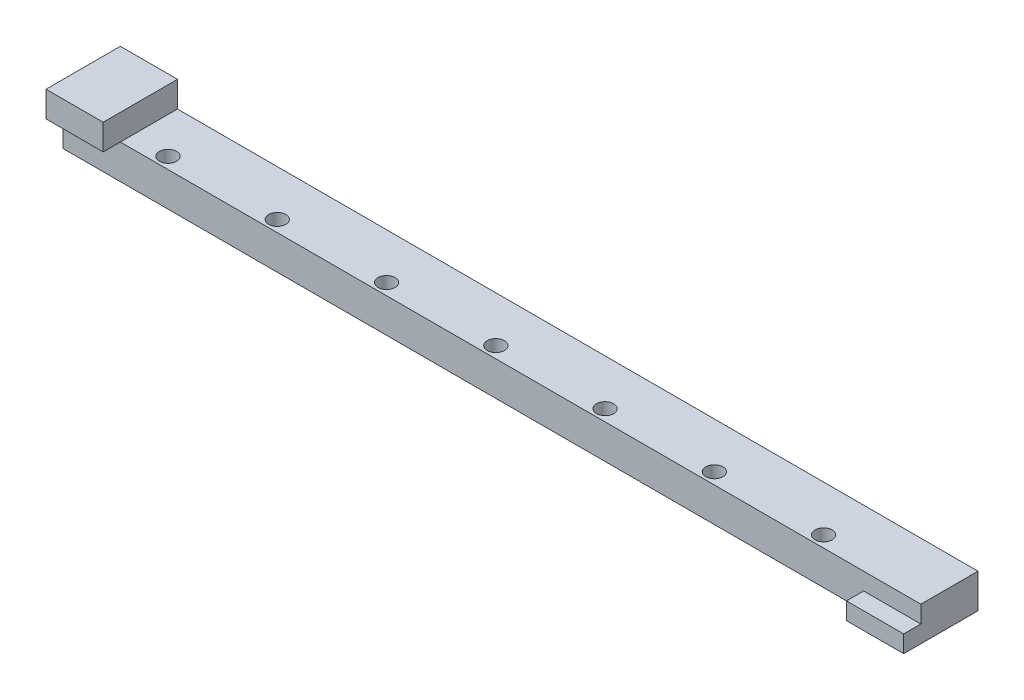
ISO-10303-21;
HEADER;
FILE_DESCRIPTION(('STEP AP214'),'2;1');
FILE_NAME('part.step','',(''),(''),'','','');
FILE_SCHEMA(('AUTOMOTIVE_DESIGN { 1 0 10303 214 1 1 1 1 }'));
ENDSEC;
DATA;
#1=APPLICATION_CONTEXT('core data for automotive mechanical design processes');
#2=APPLICATION_PROTOCOL_DEFINITION('international standard','automotive_design',2000,#1);
#3=PRODUCT_CONTEXT('',#1,'mechanical');
#4=PRODUCT('Part','Part','',(#3));
#5=PRODUCT_RELATED_PRODUCT_CATEGORY('part','',(#4));
#6=PRODUCT_DEFINITION_FORMATION('','',#4);
#7=PRODUCT_DEFINITION_CONTEXT('part definition',#1,'design');
#8=PRODUCT_DEFINITION('design','',#6,#7);
#9=PRODUCT_DEFINITION_SHAPE('','',#8);
#10=(LENGTH_UNIT() NAMED_UNIT(*) SI_UNIT(.MILLI.,.METRE.));
#11=(NAMED_UNIT(*) PLANE_ANGLE_UNIT() SI_UNIT($,.RADIAN.));
#12=(NAMED_UNIT(*) SI_UNIT($,.STERADIAN.) SOLID_ANGLE_UNIT());
#13=UNCERTAINTY_MEASURE_WITH_UNIT(LENGTH_MEASURE(1.E-05),#10,'distance_accuracy_value','');
#14=(GEOMETRIC_REPRESENTATION_CONTEXT(3) GLOBAL_UNCERTAINTY_ASSIGNED_CONTEXT((#13)) GLOBAL_UNIT_ASSIGNED_CONTEXT((#10,
#11,#12)) REPRESENTATION_CONTEXT('',''));
#15=CARTESIAN_POINT('',(0.,0.,0.));
#16=DIRECTION('',(0.,0.,1.));
#17=DIRECTION('',(1.,0.,0.));
#18=AXIS2_PLACEMENT_3D('',#15,#16,#17);
#19=CARTESIAN_POINT('',(0.,6.,0.));
#20=DIRECTION('',(0.,0.,-1.));
#21=DIRECTION('',(-1.,0.,0.));
#22=AXIS2_PLACEMENT_3D('',#19,#20,#21);
#23=PLANE('',#22);
#24=DIRECTION('',(1.,0.,0.));
#25=VECTOR('',#24,1.);
#26=CARTESIAN_POINT('',(10.,6.,0.));
#27=LINE('',#26,#25);
#28=CARTESIAN_POINT('',(0.,6.,0.));
#29=VERTEX_POINT('',#28);
#30=CARTESIAN_POINT('',(10.,6.,0.));
#31=VERTEX_POINT('',#30);
#32=EDGE_CURVE('E147',#29,#31,#27,.T.);
#33=ORIENTED_EDGE('',*,*,#32,.F.);
#34=DIRECTION('',(0.,-1.,0.));
#35=VECTOR('',#34,1.);
#36=CARTESIAN_POINT('',(0.,6.,0.));
#37=LINE('',#36,#35);
#38=CARTESIAN_POINT('',(0.,0.,0.));
#39=VERTEX_POINT('',#38);
#40=EDGE_CURVE('E11',#29,#39,#37,.T.);
#41=ORIENTED_EDGE('',*,*,#40,.T.);
#42=DIRECTION('',(1.,0.,0.));
#43=VECTOR('',#42,1.);
#44=CARTESIAN_POINT('',(0.,0.,0.));
#45=LINE('',#44,#43);
#46=CARTESIAN_POINT('',(140.,0.,0.));
#47=VERTEX_POINT('',#46);
#48=EDGE_CURVE('E60',#39,#47,#45,.T.);
#49=ORIENTED_EDGE('',*,*,#48,.T.);
#50=DIRECTION('',(0.,-1.,0.));
#51=VECTOR('',#50,1.);
#52=CARTESIAN_POINT('',(140.,3.,0.));
#53=LINE('',#52,#51);
#54=CARTESIAN_POINT('',(140.,3.,0.));
#55=VERTEX_POINT('',#54);
#56=EDGE_CURVE('E235',#55,#47,#53,.T.);
#57=ORIENTED_EDGE('',*,*,#56,.F.);
#58=DIRECTION('',(-1.,0.,0.));
#59=VECTOR('',#58,1.);
#60=CARTESIAN_POINT('',(150.,3.,0.));
#61=LINE('',#60,#59);
#62=CARTESIAN_POINT('',(150.,3.,0.));
#63=VERTEX_POINT('',#62);
#64=EDGE_CURVE('E55',#63,#55,#61,.T.);
#65=ORIENTED_EDGE('',*,*,#64,.F.);
#66=DIRECTION('',(0.,-1.,0.));
#67=VECTOR('',#66,1.);
#68=CARTESIAN_POINT('',(150.,6.,0.));
#69=LINE('',#68,#67);
#70=CARTESIAN_POINT('',(150.,6.,0.));
#71=VERTEX_POINT('',#70);
#72=EDGE_CURVE('E48',#71,#63,#69,.T.);
#73=ORIENTED_EDGE('',*,*,#72,.F.);
#74=DIRECTION('',(1.,0.,0.));
#75=VECTOR('',#74,1.);
#76=CARTESIAN_POINT('',(0.,6.,0.));
#77=LINE('',#76,#75);
#78=EDGE_CURVE('E262',#31,#71,#77,.T.);
#79=ORIENTED_EDGE('',*,*,#78,.F.);
#80=EDGE_LOOP('',(#33,#41,#49,#57,#65,#73,#79));
#81=FACE_BOUND('',#80,.T.);
#82=ADVANCED_FACE('F39',(#81),#23,.F.);
#83=CARTESIAN_POINT('',(0.,6.,-10.));
#84=DIRECTION('',(1.,0.,0.));
#85=DIRECTION('',(0.,0.,-1.));
#86=AXIS2_PLACEMENT_3D('',#83,#84,#85);
#87=PLANE('',#86);
#88=DIRECTION('',(0.,0.,1.));
#89=VECTOR('',#88,1.);
#90=CARTESIAN_POINT('',(0.,0.,-10.));
#91=LINE('',#90,#89);
#92=CARTESIAN_POINT('',(0.,0.,-10.));
#93=VERTEX_POINT('',#92);
#94=EDGE_CURVE('E261',#93,#39,#91,.T.);
#95=ORIENTED_EDGE('',*,*,#94,.T.);
#96=ORIENTED_EDGE('',*,*,#40,.F.);
#97=DIRECTION('',(0.,0.,-1.));
#98=VECTOR('',#97,1.);
#99=CARTESIAN_POINT('',(0.,6.,3.));
#100=LINE('',#99,#98);
#101=CARTESIAN_POINT('',(0.,6.,3.));
#102=VERTEX_POINT('',#101);
#103=EDGE_CURVE('E136',#102,#29,#100,.T.);
#104=ORIENTED_EDGE('',*,*,#103,.F.);
#105=DIRECTION('',(0.,-1.,0.));
#106=VECTOR('',#105,1.);
#107=CARTESIAN_POINT('',(0.,6.,3.));
#108=LINE('',#107,#106);
#109=CARTESIAN_POINT('',(0.,10.5,3.));
#110=VERTEX_POINT('',#109);
#111=EDGE_CURVE('E133',#110,#102,#108,.T.);
#112=ORIENTED_EDGE('',*,*,#111,.F.);
#113=DIRECTION('',(0.,0.,1.));
#114=VECTOR('',#113,1.);
#115=CARTESIAN_POINT('',(0.,10.5,-10.));
#116=LINE('',#115,#114);
#117=CARTESIAN_POINT('',(0.,10.5,-10.));
#118=VERTEX_POINT('',#117);
#119=EDGE_CURVE('E120',#118,#110,#116,.T.);
#120=ORIENTED_EDGE('',*,*,#119,.F.);
#121=DIRECTION('',(0.,-1.,0.));
#122=VECTOR('',#121,1.);
#123=CARTESIAN_POINT('',(0.,6.,-10.));
#124=LINE('',#123,#122);
#125=EDGE_CURVE('E272',#118,#93,#124,.T.);
#126=ORIENTED_EDGE('',*,*,#125,.T.);
#127=EDGE_LOOP('',(#95,#96,#104,#112,#120,#126));
#128=FACE_BOUND('',#127,.T.);
#129=ADVANCED_FACE('F41',(#128),#87,.F.);
#130=CARTESIAN_POINT('',(150.,6.,0.));
#131=DIRECTION('',(-1.,0.,0.));
#132=DIRECTION('',(0.,0.,1.));
#133=AXIS2_PLACEMENT_3D('',#130,#131,#132);
#134=PLANE('',#133);
#135=DIRECTION('',(0.,0.,-1.));
#136=VECTOR('',#135,1.);
#137=CARTESIAN_POINT('',(150.,0.,0.));
#138=LINE('',#137,#136);
#139=CARTESIAN_POINT('',(150.,0.,3.));
#140=VERTEX_POINT('',#139);
#141=CARTESIAN_POINT('',(150.,0.,-10.));
#142=VERTEX_POINT('',#141);
#143=EDGE_CURVE('E277',#140,#142,#138,.T.);
#144=ORIENTED_EDGE('',*,*,#143,.T.);
#145=DIRECTION('',(0.,-1.,0.));
#146=VECTOR('',#145,1.);
#147=CARTESIAN_POINT('',(150.,6.,-10.));
#148=LINE('',#147,#146);
#149=CARTESIAN_POINT('',(150.,6.,-10.));
#150=VERTEX_POINT('',#149);
#151=EDGE_CURVE('E284',#150,#142,#148,.T.);
#152=ORIENTED_EDGE('',*,*,#151,.F.);
#153=DIRECTION('',(0.,0.,-1.));
#154=VECTOR('',#153,1.);
#155=CARTESIAN_POINT('',(150.,6.,0.));
#156=LINE('',#155,#154);
#157=EDGE_CURVE('E265',#71,#150,#156,.T.);
#158=ORIENTED_EDGE('',*,*,#157,.F.);
#159=ORIENTED_EDGE('',*,*,#72,.T.);
#160=DIRECTION('',(0.,0.,-1.));
#161=VECTOR('',#160,1.);
#162=CARTESIAN_POINT('',(150.,3.,3.));
#163=LINE('',#162,#161);
#164=CARTESIAN_POINT('',(150.,3.,3.));
#165=VERTEX_POINT('',#164);
#166=EDGE_CURVE('E257',#165,#63,#163,.T.);
#167=ORIENTED_EDGE('',*,*,#166,.F.);
#168=DIRECTION('',(0.,1.,0.));
#169=VECTOR('',#168,1.);
#170=CARTESIAN_POINT('',(150.,0.,3.));
#171=LINE('',#170,#169);
#172=EDGE_CURVE('E230',#140,#165,#171,.T.);
#173=ORIENTED_EDGE('',*,*,#172,.F.);
#174=EDGE_LOOP('',(#144,#152,#158,#159,#167,#173));
#175=FACE_BOUND('',#174,.T.);
#176=ADVANCED_FACE('F291',(#175),#134,.F.);
#177=CARTESIAN_POINT('',(150.,6.,-10.));
#178=DIRECTION('',(0.,0.,1.));
#179=DIRECTION('',(1.,0.,0.));
#180=AXIS2_PLACEMENT_3D('',#177,#178,#179);
#181=PLANE('',#180);
#182=DIRECTION('',(-1.,0.,0.));
#183=VECTOR('',#182,1.);
#184=CARTESIAN_POINT('',(150.,0.,-10.));
#185=LINE('',#184,#183);
#186=EDGE_CURVE('E266',#142,#93,#185,.T.);
#187=ORIENTED_EDGE('',*,*,#186,.T.);
#188=ORIENTED_EDGE('',*,*,#125,.F.);
#189=DIRECTION('',(-1.,0.,0.));
#190=VECTOR('',#189,1.);
#191=CARTESIAN_POINT('',(10.,10.5,-10.));
#192=LINE('',#191,#190);
#193=CARTESIAN_POINT('',(10.,10.5,-10.));
#194=VERTEX_POINT('',#193);
#195=EDGE_CURVE('E126',#194,#118,#192,.T.);
#196=ORIENTED_EDGE('',*,*,#195,.F.);
#197=DIRECTION('',(0.,-1.,0.));
#198=VECTOR('',#197,1.);
#199=CARTESIAN_POINT('',(10.,10.5,-10.));
#200=LINE('',#199,#198);
#201=CARTESIAN_POINT('',(10.,6.,-10.));
#202=VERTEX_POINT('',#201);
#203=EDGE_CURVE('E167',#194,#202,#200,.T.);
#204=ORIENTED_EDGE('',*,*,#203,.T.);
#205=DIRECTION('',(-1.,0.,0.));
#206=VECTOR('',#205,1.);
#207=CARTESIAN_POINT('',(150.,6.,-10.));
#208=LINE('',#207,#206);
#209=EDGE_CURVE('E269',#150,#202,#208,.T.);
#210=ORIENTED_EDGE('',*,*,#209,.F.);
#211=ORIENTED_EDGE('',*,*,#151,.T.);
#212=EDGE_LOOP('',(#187,#188,#196,#204,#210,#211));
#213=FACE_BOUND('',#212,.T.);
#214=ADVANCED_FACE('F306',(#213),#181,.F.);
#215=CARTESIAN_POINT('',(0.,6.,0.));
#216=DIRECTION('',(0.,1.,0.));
#217=DIRECTION('',(0.,0.,1.));
#218=AXIS2_PLACEMENT_3D('',#215,#216,#217);
#219=PLANE('',#218);
#220=DIRECTION('',(0.,0.,-1.));
#221=VECTOR('',#220,1.);
#222=CARTESIAN_POINT('',(10.,6.,0.));
#223=LINE('',#222,#221);
#224=EDGE_CURVE('E162',#31,#202,#223,.T.);
#225=ORIENTED_EDGE('',*,*,#224,.F.);
#226=ORIENTED_EDGE('',*,*,#78,.T.);
#227=ORIENTED_EDGE('',*,*,#157,.T.);
#228=ORIENTED_EDGE('',*,*,#209,.T.);
#229=EDGE_LOOP('',(#225,#226,#227,#228));
#230=FACE_BOUND('',#229,.T.);
#231=CARTESIAN_POINT('',(131.,6.,-2.));
#232=DIRECTION('',(0.,1.,0.));
#233=DIRECTION('',(0.,0.,1.));
#234=AXIS2_PLACEMENT_3D('',#231,#232,#233);
#235=CIRCLE('',#234,1.5);
#236=CARTESIAN_POINT('',(131.,6.,-0.500000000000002));
#237=VERTEX_POINT('',#236);
#238=EDGE_CURVE('E179',#237,#237,#235,.T.);
#239=ORIENTED_EDGE('',*,*,#238,.F.);
#240=EDGE_LOOP('',(#239));
#241=FACE_BOUND('',#240,.T.);
#242=CARTESIAN_POINT('',(54.56,6.,-1.99999999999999));
#243=DIRECTION('',(0.,1.,0.));
#244=DIRECTION('',(0.,0.,1.));
#245=AXIS2_PLACEMENT_3D('',#242,#243,#244);
#246=CIRCLE('',#245,1.5);
#247=CARTESIAN_POINT('',(54.56,6.,-0.499999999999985));
#248=VERTEX_POINT('',#247);
#249=EDGE_CURVE('E174',#248,#248,#246,.T.);
#250=ORIENTED_EDGE('',*,*,#249,.F.);
#251=EDGE_LOOP('',(#250));
#252=FACE_BOUND('',#251,.T.);
#253=CARTESIAN_POINT('',(35.45,6.,-1.99999999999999));
#254=DIRECTION('',(0.,1.,0.));
#255=DIRECTION('',(0.,0.,1.));
#256=AXIS2_PLACEMENT_3D('',#253,#254,#255);
#257=CIRCLE('',#256,1.5);
#258=CARTESIAN_POINT('',(35.45,6.,-0.499999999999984));
#259=VERTEX_POINT('',#258);
#260=EDGE_CURVE('E189',#259,#259,#257,.T.);
#261=ORIENTED_EDGE('',*,*,#260,.F.);
#262=EDGE_LOOP('',(#261));
#263=FACE_BOUND('',#262,.T.);
#264=CARTESIAN_POINT('',(16.34,6.,-1.99999999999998));
#265=DIRECTION('',(0.,1.,0.));
#266=DIRECTION('',(0.,0.,1.));
#267=AXIS2_PLACEMENT_3D('',#264,#265,#266);
#268=CIRCLE('',#267,1.5);
#269=CARTESIAN_POINT('',(16.34,6.,-0.499999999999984));
#270=VERTEX_POINT('',#269);
#271=EDGE_CURVE('E188',#270,#270,#268,.T.);
#272=ORIENTED_EDGE('',*,*,#271,.F.);
#273=EDGE_LOOP('',(#272));
#274=FACE_BOUND('',#273,.T.);
#275=CARTESIAN_POINT('',(73.67,6.,-1.99999999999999));
#276=DIRECTION('',(0.,1.,0.));
#277=DIRECTION('',(0.,0.,1.));
#278=AXIS2_PLACEMENT_3D('',#275,#276,#277);
#279=CIRCLE('',#278,1.5);
#280=CARTESIAN_POINT('',(73.67,6.,-0.499999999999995));
#281=VERTEX_POINT('',#280);
#282=EDGE_CURVE('E219',#281,#281,#279,.T.);
#283=ORIENTED_EDGE('',*,*,#282,.F.);
#284=EDGE_LOOP('',(#283));
#285=FACE_BOUND('',#284,.T.);
#286=CARTESIAN_POINT('',(92.78,6.,-1.99999999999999));
#287=DIRECTION('',(0.,1.,0.));
#288=DIRECTION('',(0.,0.,1.));
#289=AXIS2_PLACEMENT_3D('',#286,#287,#288);
#290=CIRCLE('',#289,1.5);
#291=CARTESIAN_POINT('',(92.78,6.,-0.499999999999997));
#292=VERTEX_POINT('',#291);
#293=EDGE_CURVE('E211',#292,#292,#290,.T.);
#294=ORIENTED_EDGE('',*,*,#293,.F.);
#295=EDGE_LOOP('',(#294));
#296=FACE_BOUND('',#295,.T.);
#297=CARTESIAN_POINT('',(111.89,6.,-2.));
#298=DIRECTION('',(0.,1.,0.));
#299=DIRECTION('',(0.,0.,1.));
#300=AXIS2_PLACEMENT_3D('',#297,#298,#299);
#301=CIRCLE('',#300,1.5);
#302=CARTESIAN_POINT('',(111.89,6.,-0.499999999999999));
#303=VERTEX_POINT('',#302);
#304=EDGE_CURVE('E203',#303,#303,#301,.T.);
#305=ORIENTED_EDGE('',*,*,#304,.F.);
#306=EDGE_LOOP('',(#305));
#307=FACE_BOUND('',#306,.T.);
#308=ADVANCED_FACE('F315',(#230,#241,#252,#263,#274,#285,#296,#307),#219,.T.);
#309=CARTESIAN_POINT('',(0.,0.,0.));
#310=DIRECTION('',(0.,1.,0.));
#311=DIRECTION('',(0.,0.,1.));
#312=AXIS2_PLACEMENT_3D('',#309,#310,#311);
#313=PLANE('',#312);
#314=CARTESIAN_POINT('',(131.,0.,-2.));
#315=DIRECTION('',(0.,1.,0.));
#316=DIRECTION('',(0.,0.,1.));
#317=AXIS2_PLACEMENT_3D('',#314,#315,#316);
#318=CIRCLE('',#317,1.5);
#319=CARTESIAN_POINT('',(131.,0.,-0.500000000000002));
#320=VERTEX_POINT('',#319);
#321=EDGE_CURVE('E175',#320,#320,#318,.T.);
#322=ORIENTED_EDGE('',*,*,#321,.T.);
#323=EDGE_LOOP('',(#322));
#324=FACE_BOUND('',#323,.T.);
#325=CARTESIAN_POINT('',(54.56,0.,-1.99999999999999));
#326=DIRECTION('',(0.,1.,0.));
#327=DIRECTION('',(0.,0.,1.));
#328=AXIS2_PLACEMENT_3D('',#325,#326,#327);
#329=CIRCLE('',#328,1.5);
#330=CARTESIAN_POINT('',(54.56,0.,-0.499999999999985));
#331=VERTEX_POINT('',#330);
#332=EDGE_CURVE('E193',#331,#331,#329,.T.);
#333=ORIENTED_EDGE('',*,*,#332,.T.);
#334=EDGE_LOOP('',(#333));
#335=FACE_BOUND('',#334,.T.);
#336=CARTESIAN_POINT('',(35.45,0.,-1.99999999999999));
#337=DIRECTION('',(0.,1.,0.));
#338=DIRECTION('',(0.,0.,1.));
#339=AXIS2_PLACEMENT_3D('',#336,#337,#338);
#340=CIRCLE('',#339,1.5);
#341=CARTESIAN_POINT('',(35.45,0.,-0.499999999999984));
#342=VERTEX_POINT('',#341);
#343=EDGE_CURVE('E184',#342,#342,#340,.T.);
#344=ORIENTED_EDGE('',*,*,#343,.T.);
#345=EDGE_LOOP('',(#344));
#346=FACE_BOUND('',#345,.T.);
#347=CARTESIAN_POINT('',(16.34,0.,-1.99999999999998));
#348=DIRECTION('',(0.,1.,0.));
#349=DIRECTION('',(0.,0.,1.));
#350=AXIS2_PLACEMENT_3D('',#347,#348,#349);
#351=CIRCLE('',#350,1.5);
#352=CARTESIAN_POINT('',(16.34,0.,-0.499999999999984));
#353=VERTEX_POINT('',#352);
#354=EDGE_CURVE('E223',#353,#353,#351,.T.);
#355=ORIENTED_EDGE('',*,*,#354,.T.);
#356=EDGE_LOOP('',(#355));
#357=FACE_BOUND('',#356,.T.);
#358=CARTESIAN_POINT('',(73.67,0.,-1.99999999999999));
#359=DIRECTION('',(0.,1.,0.));
#360=DIRECTION('',(0.,0.,1.));
#361=AXIS2_PLACEMENT_3D('',#358,#359,#360);
#362=CIRCLE('',#361,1.5);
#363=CARTESIAN_POINT('',(73.67,0.,-0.499999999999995));
#364=VERTEX_POINT('',#363);
#365=EDGE_CURVE('E215',#364,#364,#362,.T.);
#366=ORIENTED_EDGE('',*,*,#365,.T.);
#367=EDGE_LOOP('',(#366));
#368=FACE_BOUND('',#367,.T.);
#369=CARTESIAN_POINT('',(92.78,0.,-1.99999999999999));
#370=DIRECTION('',(0.,1.,0.));
#371=DIRECTION('',(0.,0.,1.));
#372=AXIS2_PLACEMENT_3D('',#369,#370,#371);
#373=CIRCLE('',#372,1.5);
#374=CARTESIAN_POINT('',(92.78,0.,-0.499999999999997));
#375=VERTEX_POINT('',#374);
#376=EDGE_CURVE('E207',#375,#375,#373,.T.);
#377=ORIENTED_EDGE('',*,*,#376,.T.);
#378=EDGE_LOOP('',(#377));
#379=FACE_BOUND('',#378,.T.);
#380=CARTESIAN_POINT('',(111.89,0.,-2.));
#381=DIRECTION('',(0.,1.,0.));
#382=DIRECTION('',(0.,0.,1.));
#383=AXIS2_PLACEMENT_3D('',#380,#381,#382);
#384=CIRCLE('',#383,1.5);
#385=CARTESIAN_POINT('',(111.89,0.,-0.499999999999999));
#386=VERTEX_POINT('',#385);
#387=EDGE_CURVE('E183',#386,#386,#384,.T.);
#388=ORIENTED_EDGE('',*,*,#387,.T.);
#389=EDGE_LOOP('',(#388));
#390=FACE_BOUND('',#389,.T.);
#391=ORIENTED_EDGE('',*,*,#94,.F.);
#392=ORIENTED_EDGE('',*,*,#186,.F.);
#393=ORIENTED_EDGE('',*,*,#143,.F.);
#394=DIRECTION('',(1.,0.,0.));
#395=VECTOR('',#394,1.);
#396=CARTESIAN_POINT('',(150.,0.,3.));
#397=LINE('',#396,#395);
#398=CARTESIAN_POINT('',(140.,0.,3.));
#399=VERTEX_POINT('',#398);
#400=EDGE_CURVE('E241',#399,#140,#397,.T.);
#401=ORIENTED_EDGE('',*,*,#400,.F.);
#402=DIRECTION('',(0.,0.,-1.));
#403=VECTOR('',#402,1.);
#404=CARTESIAN_POINT('',(140.,0.,3.));
#405=LINE('',#404,#403);
#406=EDGE_CURVE('E245',#399,#47,#405,.T.);
#407=ORIENTED_EDGE('',*,*,#406,.T.);
#408=ORIENTED_EDGE('',*,*,#48,.F.);
#409=EDGE_LOOP('',(#391,#392,#393,#401,#407,#408));
#410=FACE_BOUND('',#409,.T.);
#411=ADVANCED_FACE('F308',(#324,#335,#346,#357,#368,#379,#390,#410),#313,.F.);
#412=CARTESIAN_POINT('',(150.,3.,3.));
#413=DIRECTION('',(0.,-1.,0.));
#414=DIRECTION('',(1.,0.,0.));
#415=AXIS2_PLACEMENT_3D('',#412,#413,#414);
#416=PLANE('',#415);
#417=ORIENTED_EDGE('',*,*,#64,.T.);
#418=DIRECTION('',(0.,0.,-1.));
#419=VECTOR('',#418,1.);
#420=CARTESIAN_POINT('',(140.,3.,3.));
#421=LINE('',#420,#419);
#422=CARTESIAN_POINT('',(140.,3.,3.));
#423=VERTEX_POINT('',#422);
#424=EDGE_CURVE('E253',#423,#55,#421,.T.);
#425=ORIENTED_EDGE('',*,*,#424,.F.);
#426=DIRECTION('',(-1.,0.,0.));
#427=VECTOR('',#426,1.);
#428=CARTESIAN_POINT('',(150.,3.,3.));
#429=LINE('',#428,#427);
#430=EDGE_CURVE('E234',#165,#423,#429,.T.);
#431=ORIENTED_EDGE('',*,*,#430,.F.);
#432=ORIENTED_EDGE('',*,*,#166,.T.);
#433=EDGE_LOOP('',(#417,#425,#431,#432));
#434=FACE_BOUND('',#433,.T.);
#435=ADVANCED_FACE('F296',(#434),#416,.F.);
#436=CARTESIAN_POINT('',(140.,3.,3.));
#437=DIRECTION('',(1.,0.,0.));
#438=DIRECTION('',(0.,0.,-1.));
#439=AXIS2_PLACEMENT_3D('',#436,#437,#438);
#440=PLANE('',#439);
#441=ORIENTED_EDGE('',*,*,#56,.T.);
#442=ORIENTED_EDGE('',*,*,#406,.F.);
#443=DIRECTION('',(0.,-1.,0.));
#444=VECTOR('',#443,1.);
#445=CARTESIAN_POINT('',(140.,3.,3.));
#446=LINE('',#445,#444);
#447=EDGE_CURVE('E238',#423,#399,#446,.T.);
#448=ORIENTED_EDGE('',*,*,#447,.F.);
#449=ORIENTED_EDGE('',*,*,#424,.T.);
#450=EDGE_LOOP('',(#441,#442,#448,#449));
#451=FACE_BOUND('',#450,.T.);
#452=ADVANCED_FACE('F344',(#451),#440,.F.);
#453=CARTESIAN_POINT('',(0.,0.,3.));
#454=DIRECTION('',(0.,0.,1.));
#455=DIRECTION('',(1.,0.,0.));
#456=AXIS2_PLACEMENT_3D('',#453,#454,#455);
#457=PLANE('',#456);
#458=ORIENTED_EDGE('',*,*,#172,.T.);
#459=ORIENTED_EDGE('',*,*,#430,.T.);
#460=ORIENTED_EDGE('',*,*,#447,.T.);
#461=ORIENTED_EDGE('',*,*,#400,.T.);
#462=EDGE_LOOP('',(#458,#459,#460,#461));
#463=FACE_BOUND('',#462,.T.);
#464=ADVANCED_FACE('F300',(#463),#457,.T.);
#465=CARTESIAN_POINT('',(111.89,0.,-2.));
#466=DIRECTION('',(0.,1.,0.));
#467=DIRECTION('',(0.,0.,1.));
#468=AXIS2_PLACEMENT_3D('',#465,#466,#467);
#469=CYLINDRICAL_SURFACE('',#468,1.5);
#470=CARTESIAN_POINT('',(111.89,0.,-0.499999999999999));
#471=CARTESIAN_POINT('',(111.89,0.0624999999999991,-0.499999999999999));
#472=CARTESIAN_POINT('',(111.89,0.124999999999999,-0.499999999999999));
#473=CARTESIAN_POINT('',(111.89,0.249999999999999,-0.499999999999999));
#474=CARTESIAN_POINT('',(111.89,0.312499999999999,-0.499999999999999));
#475=CARTESIAN_POINT('',(111.89,0.437499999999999,-0.499999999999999));
#476=CARTESIAN_POINT('',(111.89,0.499999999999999,-0.499999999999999));
#477=CARTESIAN_POINT('',(111.89,0.624999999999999,-0.499999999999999));
#478=CARTESIAN_POINT('',(111.89,0.687499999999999,-0.499999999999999));
#479=CARTESIAN_POINT('',(111.89,0.812499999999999,-0.499999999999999));
#480=CARTESIAN_POINT('',(111.89,0.874999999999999,-0.499999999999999));
#481=CARTESIAN_POINT('',(111.89,0.999999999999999,-0.499999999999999));
#482=CARTESIAN_POINT('',(111.89,1.0625,-0.499999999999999));
#483=CARTESIAN_POINT('',(111.89,1.1875,-0.499999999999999));
#484=CARTESIAN_POINT('',(111.89,1.25,-0.499999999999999));
#485=CARTESIAN_POINT('',(111.89,1.375,-0.499999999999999));
#486=CARTESIAN_POINT('',(111.89,1.4375,-0.499999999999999));
#487=CARTESIAN_POINT('',(111.89,1.5625,-0.499999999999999));
#488=CARTESIAN_POINT('',(111.89,1.625,-0.499999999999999));
#489=CARTESIAN_POINT('',(111.89,1.75,-0.499999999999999));
#490=CARTESIAN_POINT('',(111.89,1.8125,-0.499999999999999));
#491=CARTESIAN_POINT('',(111.89,1.9375,-0.499999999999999));
#492=CARTESIAN_POINT('',(111.89,2.,-0.499999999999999));
#493=CARTESIAN_POINT('',(111.89,2.125,-0.499999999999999));
#494=CARTESIAN_POINT('',(111.89,2.1875,-0.499999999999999));
#495=CARTESIAN_POINT('',(111.89,2.3125,-0.499999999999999));
#496=CARTESIAN_POINT('',(111.89,2.375,-0.499999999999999));
#497=CARTESIAN_POINT('',(111.89,2.5,-0.499999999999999));
#498=CARTESIAN_POINT('',(111.89,2.5625,-0.499999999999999));
#499=CARTESIAN_POINT('',(111.89,2.6875,-0.499999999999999));
#500=CARTESIAN_POINT('',(111.89,2.75,-0.499999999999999));
#501=CARTESIAN_POINT('',(111.89,2.875,-0.499999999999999));
#502=CARTESIAN_POINT('',(111.89,2.9375,-0.499999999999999));
#503=CARTESIAN_POINT('',(111.89,3.0625,-0.499999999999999));
#504=CARTESIAN_POINT('',(111.89,3.125,-0.499999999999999));
#505=CARTESIAN_POINT('',(111.89,3.25,-0.499999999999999));
#506=CARTESIAN_POINT('',(111.89,3.3125,-0.499999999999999));
#507=CARTESIAN_POINT('',(111.89,3.4375,-0.499999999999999));
#508=CARTESIAN_POINT('',(111.89,3.5,-0.499999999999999));
#509=CARTESIAN_POINT('',(111.89,3.625,-0.499999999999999));
#510=CARTESIAN_POINT('',(111.89,3.6875,-0.499999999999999));
#511=CARTESIAN_POINT('',(111.89,3.8125,-0.499999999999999));
#512=CARTESIAN_POINT('',(111.89,3.875,-0.499999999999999));
#513=CARTESIAN_POINT('',(111.89,4.,-0.499999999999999));
#514=CARTESIAN_POINT('',(111.89,4.0625,-0.499999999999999));
#515=CARTESIAN_POINT('',(111.89,4.1875,-0.499999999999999));
#516=CARTESIAN_POINT('',(111.89,4.25,-0.499999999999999));
#517=CARTESIAN_POINT('',(111.89,4.375,-0.499999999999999));
#518=CARTESIAN_POINT('',(111.89,4.4375,-0.499999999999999));
#519=CARTESIAN_POINT('',(111.89,4.5625,-0.499999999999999));
#520=CARTESIAN_POINT('',(111.89,4.625,-0.499999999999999));
#521=CARTESIAN_POINT('',(111.89,4.75,-0.499999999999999));
#522=CARTESIAN_POINT('',(111.89,4.8125,-0.499999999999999));
#523=CARTESIAN_POINT('',(111.89,4.9375,-0.499999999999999));
#524=CARTESIAN_POINT('',(111.89,5.,-0.499999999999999));
#525=CARTESIAN_POINT('',(111.89,5.125,-0.499999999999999));
#526=CARTESIAN_POINT('',(111.89,5.1875,-0.499999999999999));
#527=CARTESIAN_POINT('',(111.89,5.3125,-0.499999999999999));
#528=CARTESIAN_POINT('',(111.89,5.375,-0.499999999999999));
#529=CARTESIAN_POINT('',(111.89,5.5,-0.499999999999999));
#530=CARTESIAN_POINT('',(111.89,5.5625,-0.499999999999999));
#531=CARTESIAN_POINT('',(111.89,5.6875,-0.499999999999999));
#532=CARTESIAN_POINT('',(111.89,5.75,-0.499999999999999));
#533=CARTESIAN_POINT('',(111.89,5.875,-0.499999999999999));
#534=CARTESIAN_POINT('',(111.89,5.9375,-0.499999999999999));
#535=CARTESIAN_POINT('',(111.89,6.,-0.499999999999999));
#536=B_SPLINE_CURVE_WITH_KNOTS('',3,(#470,#471,#472,#473,#474,#475,#476,#477,#478,#479,#480,
#481,#482,#483,#484,#485,#486,#487,#488,#489,#490,#491,#492,#493,#494,#495,#496,#497,#498,#499,
#500,#501,#502,#503,#504,#505,#506,#507,#508,#509,#510,#511,#512,#513,#514,#515,#516,#517,#518,
#519,#520,#521,#522,#523,#524,#525,#526,#527,#528,#529,#530,#531,#532,#533,#534,#535),
.UNSPECIFIED.,.F.,.F.,(4,2,2,2,2,2,2,2,2,2,2,2,2,2,2,2,2,2,2,2,2,2,2,2,2,2,2,2,2,2,2,2,4),(0.,
0.1875,0.375,0.5625,0.75,0.9375,1.125,1.3125,1.5,1.6875,1.875,2.0625,2.25,2.4375,2.625,2.8125,
3.,3.1875,3.375,3.5625,3.75,3.9375,4.125,4.3125,4.5,4.6875,4.875,5.0625,5.25,5.4375,5.625,
5.8125,6.),.UNSPECIFIED.);
#537=EDGE_CURVE('BSEAM350',#386,#303,#536,.T.);
#538=ORIENTED_EDGE('',*,*,#387,.F.);
#539=ORIENTED_EDGE('',*,*,#304,.T.);
#540=ORIENTED_EDGE('',*,*,#537,.T.);
#541=ORIENTED_EDGE('',*,*,#537,.F.);
#542=EDGE_LOOP('',(#538,#540,#539,#541));
#543=FACE_BOUND('',#542,.T.);
#544=ADVANCED_FACE('F350',(#543),#469,.F.);
#545=CARTESIAN_POINT('',(92.78,0.,-1.99999999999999));
#546=DIRECTION('',(0.,1.,0.));
#547=DIRECTION('',(0.,0.,1.));
#548=AXIS2_PLACEMENT_3D('',#545,#546,#547);
#549=CYLINDRICAL_SURFACE('',#548,1.5);
#550=CARTESIAN_POINT('',(92.78,0.,-0.499999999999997));
#551=CARTESIAN_POINT('',(92.78,0.0624999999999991,-0.499999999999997));
#552=CARTESIAN_POINT('',(92.78,0.124999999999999,-0.499999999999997));
#553=CARTESIAN_POINT('',(92.78,0.249999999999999,-0.499999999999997));
#554=CARTESIAN_POINT('',(92.78,0.312499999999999,-0.499999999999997));
#555=CARTESIAN_POINT('',(92.78,0.437499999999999,-0.499999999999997));
#556=CARTESIAN_POINT('',(92.78,0.499999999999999,-0.499999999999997));
#557=CARTESIAN_POINT('',(92.78,0.624999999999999,-0.499999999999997));
#558=CARTESIAN_POINT('',(92.78,0.687499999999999,-0.499999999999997));
#559=CARTESIAN_POINT('',(92.78,0.812499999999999,-0.499999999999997));
#560=CARTESIAN_POINT('',(92.78,0.874999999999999,-0.499999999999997));
#561=CARTESIAN_POINT('',(92.78,0.999999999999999,-0.499999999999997));
#562=CARTESIAN_POINT('',(92.78,1.0625,-0.499999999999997));
#563=CARTESIAN_POINT('',(92.78,1.1875,-0.499999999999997));
#564=CARTESIAN_POINT('',(92.78,1.25,-0.499999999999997));
#565=CARTESIAN_POINT('',(92.78,1.375,-0.499999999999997));
#566=CARTESIAN_POINT('',(92.78,1.4375,-0.499999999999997));
#567=CARTESIAN_POINT('',(92.78,1.5625,-0.499999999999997));
#568=CARTESIAN_POINT('',(92.78,1.625,-0.499999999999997));
#569=CARTESIAN_POINT('',(92.78,1.75,-0.499999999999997));
#570=CARTESIAN_POINT('',(92.78,1.8125,-0.499999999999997));
#571=CARTESIAN_POINT('',(92.78,1.9375,-0.499999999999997));
#572=CARTESIAN_POINT('',(92.78,2.,-0.499999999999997));
#573=CARTESIAN_POINT('',(92.78,2.125,-0.499999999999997));
#574=CARTESIAN_POINT('',(92.78,2.1875,-0.499999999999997));
#575=CARTESIAN_POINT('',(92.78,2.3125,-0.499999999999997));
#576=CARTESIAN_POINT('',(92.78,2.375,-0.499999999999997));
#577=CARTESIAN_POINT('',(92.78,2.5,-0.499999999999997));
#578=CARTESIAN_POINT('',(92.78,2.5625,-0.499999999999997));
#579=CARTESIAN_POINT('',(92.78,2.6875,-0.499999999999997));
#580=CARTESIAN_POINT('',(92.78,2.75,-0.499999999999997));
#581=CARTESIAN_POINT('',(92.78,2.875,-0.499999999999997));
#582=CARTESIAN_POINT('',(92.78,2.9375,-0.499999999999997));
#583=CARTESIAN_POINT('',(92.78,3.0625,-0.499999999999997));
#584=CARTESIAN_POINT('',(92.78,3.125,-0.499999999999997));
#585=CARTESIAN_POINT('',(92.78,3.25,-0.499999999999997));
#586=CARTESIAN_POINT('',(92.78,3.3125,-0.499999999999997));
#587=CARTESIAN_POINT('',(92.78,3.4375,-0.499999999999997));
#588=CARTESIAN_POINT('',(92.78,3.5,-0.499999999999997));
#589=CARTESIAN_POINT('',(92.78,3.625,-0.499999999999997));
#590=CARTESIAN_POINT('',(92.78,3.6875,-0.499999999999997));
#591=CARTESIAN_POINT('',(92.78,3.8125,-0.499999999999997));
#592=CARTESIAN_POINT('',(92.78,3.875,-0.499999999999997));
#593=CARTESIAN_POINT('',(92.78,4.,-0.499999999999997));
#594=CARTESIAN_POINT('',(92.78,4.0625,-0.499999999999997));
#595=CARTESIAN_POINT('',(92.78,4.1875,-0.499999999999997));
#596=CARTESIAN_POINT('',(92.78,4.25,-0.499999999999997));
#597=CARTESIAN_POINT('',(92.78,4.375,-0.499999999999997));
#598=CARTESIAN_POINT('',(92.78,4.4375,-0.499999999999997));
#599=CARTESIAN_POINT('',(92.78,4.5625,-0.499999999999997));
#600=CARTESIAN_POINT('',(92.78,4.625,-0.499999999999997));
#601=CARTESIAN_POINT('',(92.78,4.75,-0.499999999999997));
#602=CARTESIAN_POINT('',(92.78,4.8125,-0.499999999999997));
#603=CARTESIAN_POINT('',(92.78,4.9375,-0.499999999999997));
#604=CARTESIAN_POINT('',(92.78,5.,-0.499999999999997));
#605=CARTESIAN_POINT('',(92.78,5.125,-0.499999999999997));
#606=CARTESIAN_POINT('',(92.78,5.1875,-0.499999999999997));
#607=CARTESIAN_POINT('',(92.78,5.3125,-0.499999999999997));
#608=CARTESIAN_POINT('',(92.78,5.375,-0.499999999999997));
#609=CARTESIAN_POINT('',(92.78,5.5,-0.499999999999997));
#610=CARTESIAN_POINT('',(92.78,5.5625,-0.499999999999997));
#611=CARTESIAN_POINT('',(92.78,5.6875,-0.499999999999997));
#612=CARTESIAN_POINT('',(92.78,5.75,-0.499999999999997));
#613=CARTESIAN_POINT('',(92.78,5.875,-0.499999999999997));
#614=CARTESIAN_POINT('',(92.78,5.9375,-0.499999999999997));
#615=CARTESIAN_POINT('',(92.78,6.,-0.499999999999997));
#616=B_SPLINE_CURVE_WITH_KNOTS('',3,(#550,#551,#552,#553,#554,#555,#556,#557,#558,#559,#560,
#561,#562,#563,#564,#565,#566,#567,#568,#569,#570,#571,#572,#573,#574,#575,#576,#577,#578,#579,
#580,#581,#582,#583,#584,#585,#586,#587,#588,#589,#590,#591,#592,#593,#594,#595,#596,#597,#598,
#599,#600,#601,#602,#603,#604,#605,#606,#607,#608,#609,#610,#611,#612,#613,#614,#615),
.UNSPECIFIED.,.F.,.F.,(4,2,2,2,2,2,2,2,2,2,2,2,2,2,2,2,2,2,2,2,2,2,2,2,2,2,2,2,2,2,2,2,4),(0.,
0.1875,0.375,0.5625,0.75,0.9375,1.125,1.3125,1.5,1.6875,1.875,2.0625,2.25,2.4375,2.625,2.8125,
3.,3.1875,3.375,3.5625,3.75,3.9375,4.125,4.3125,4.5,4.6875,4.875,5.0625,5.25,5.4375,5.625,
5.8125,6.),.UNSPECIFIED.);
#617=EDGE_CURVE('BSEAM359',#375,#292,#616,.T.);
#618=ORIENTED_EDGE('',*,*,#376,.F.);
#619=ORIENTED_EDGE('',*,*,#293,.T.);
#620=ORIENTED_EDGE('',*,*,#617,.T.);
#621=ORIENTED_EDGE('',*,*,#617,.F.);
#622=EDGE_LOOP('',(#618,#620,#619,#621));
#623=FACE_BOUND('',#622,.T.);
#624=ADVANCED_FACE('F359',(#623),#549,.F.);
#625=CARTESIAN_POINT('',(73.67,0.,-1.99999999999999));
#626=DIRECTION('',(0.,1.,0.));
#627=DIRECTION('',(0.,0.,1.));
#628=AXIS2_PLACEMENT_3D('',#625,#626,#627);
#629=CYLINDRICAL_SURFACE('',#628,1.5);
#630=CARTESIAN_POINT('',(73.67,0.,-0.499999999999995));
#631=CARTESIAN_POINT('',(73.67,0.0624999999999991,-0.499999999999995));
#632=CARTESIAN_POINT('',(73.67,0.124999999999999,-0.499999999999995));
#633=CARTESIAN_POINT('',(73.67,0.249999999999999,-0.499999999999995));
#634=CARTESIAN_POINT('',(73.67,0.312499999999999,-0.499999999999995));
#635=CARTESIAN_POINT('',(73.67,0.437499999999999,-0.499999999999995));
#636=CARTESIAN_POINT('',(73.67,0.499999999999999,-0.499999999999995));
#637=CARTESIAN_POINT('',(73.67,0.624999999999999,-0.499999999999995));
#638=CARTESIAN_POINT('',(73.67,0.687499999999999,-0.499999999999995));
#639=CARTESIAN_POINT('',(73.67,0.812499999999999,-0.499999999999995));
#640=CARTESIAN_POINT('',(73.67,0.874999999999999,-0.499999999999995));
#641=CARTESIAN_POINT('',(73.67,0.999999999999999,-0.499999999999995));
#642=CARTESIAN_POINT('',(73.67,1.0625,-0.499999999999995));
#643=CARTESIAN_POINT('',(73.67,1.1875,-0.499999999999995));
#644=CARTESIAN_POINT('',(73.67,1.25,-0.499999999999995));
#645=CARTESIAN_POINT('',(73.67,1.375,-0.499999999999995));
#646=CARTESIAN_POINT('',(73.67,1.4375,-0.499999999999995));
#647=CARTESIAN_POINT('',(73.67,1.5625,-0.499999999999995));
#648=CARTESIAN_POINT('',(73.67,1.625,-0.499999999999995));
#649=CARTESIAN_POINT('',(73.67,1.75,-0.499999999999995));
#650=CARTESIAN_POINT('',(73.67,1.8125,-0.499999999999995));
#651=CARTESIAN_POINT('',(73.67,1.9375,-0.499999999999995));
#652=CARTESIAN_POINT('',(73.67,2.,-0.499999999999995));
#653=CARTESIAN_POINT('',(73.67,2.125,-0.499999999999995));
#654=CARTESIAN_POINT('',(73.67,2.1875,-0.499999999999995));
#655=CARTESIAN_POINT('',(73.67,2.3125,-0.499999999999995));
#656=CARTESIAN_POINT('',(73.67,2.375,-0.499999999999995));
#657=CARTESIAN_POINT('',(73.67,2.5,-0.499999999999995));
#658=CARTESIAN_POINT('',(73.67,2.5625,-0.499999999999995));
#659=CARTESIAN_POINT('',(73.67,2.6875,-0.499999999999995));
#660=CARTESIAN_POINT('',(73.67,2.75,-0.499999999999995));
#661=CARTESIAN_POINT('',(73.67,2.875,-0.499999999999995));
#662=CARTESIAN_POINT('',(73.67,2.9375,-0.499999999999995));
#663=CARTESIAN_POINT('',(73.67,3.0625,-0.499999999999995));
#664=CARTESIAN_POINT('',(73.67,3.125,-0.499999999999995));
#665=CARTESIAN_POINT('',(73.67,3.25,-0.499999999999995));
#666=CARTESIAN_POINT('',(73.67,3.3125,-0.499999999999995));
#667=CARTESIAN_POINT('',(73.67,3.4375,-0.499999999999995));
#668=CARTESIAN_POINT('',(73.67,3.5,-0.499999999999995));
#669=CARTESIAN_POINT('',(73.67,3.625,-0.499999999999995));
#670=CARTESIAN_POINT('',(73.67,3.6875,-0.499999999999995));
#671=CARTESIAN_POINT('',(73.67,3.8125,-0.499999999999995));
#672=CARTESIAN_POINT('',(73.67,3.875,-0.499999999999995));
#673=CARTESIAN_POINT('',(73.67,4.,-0.499999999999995));
#674=CARTESIAN_POINT('',(73.67,4.0625,-0.499999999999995));
#675=CARTESIAN_POINT('',(73.67,4.1875,-0.499999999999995));
#676=CARTESIAN_POINT('',(73.67,4.25,-0.499999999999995));
#677=CARTESIAN_POINT('',(73.67,4.375,-0.499999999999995));
#678=CARTESIAN_POINT('',(73.67,4.4375,-0.499999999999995));
#679=CARTESIAN_POINT('',(73.67,4.5625,-0.499999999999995));
#680=CARTESIAN_POINT('',(73.67,4.625,-0.499999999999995));
#681=CARTESIAN_POINT('',(73.67,4.75,-0.499999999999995));
#682=CARTESIAN_POINT('',(73.67,4.8125,-0.499999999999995));
#683=CARTESIAN_POINT('',(73.67,4.9375,-0.499999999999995));
#684=CARTESIAN_POINT('',(73.67,5.,-0.499999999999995));
#685=CARTESIAN_POINT('',(73.67,5.125,-0.499999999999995));
#686=CARTESIAN_POINT('',(73.67,5.1875,-0.499999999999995));
#687=CARTESIAN_POINT('',(73.67,5.3125,-0.499999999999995));
#688=CARTESIAN_POINT('',(73.67,5.375,-0.499999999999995));
#689=CARTESIAN_POINT('',(73.67,5.5,-0.499999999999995));
#690=CARTESIAN_POINT('',(73.67,5.5625,-0.499999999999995));
#691=CARTESIAN_POINT('',(73.67,5.6875,-0.499999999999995));
#692=CARTESIAN_POINT('',(73.67,5.75,-0.499999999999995));
#693=CARTESIAN_POINT('',(73.67,5.875,-0.499999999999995));
#694=CARTESIAN_POINT('',(73.67,5.9375,-0.499999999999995));
#695=CARTESIAN_POINT('',(73.67,6.,-0.499999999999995));
#696=B_SPLINE_CURVE_WITH_KNOTS('',3,(#630,#631,#632,#633,#634,#635,#636,#637,#638,#639,#640,
#641,#642,#643,#644,#645,#646,#647,#648,#649,#650,#651,#652,#653,#654,#655,#656,#657,#658,#659,
#660,#661,#662,#663,#664,#665,#666,#667,#668,#669,#670,#671,#672,#673,#674,#675,#676,#677,#678,
#679,#680,#681,#682,#683,#684,#685,#686,#687,#688,#689,#690,#691,#692,#693,#694,#695),
.UNSPECIFIED.,.F.,.F.,(4,2,2,2,2,2,2,2,2,2,2,2,2,2,2,2,2,2,2,2,2,2,2,2,2,2,2,2,2,2,2,2,4),(0.,
0.1875,0.375,0.5625,0.75,0.9375,1.125,1.3125,1.5,1.6875,1.875,2.0625,2.25,2.4375,2.625,2.8125,
3.,3.1875,3.375,3.5625,3.75,3.9375,4.125,4.3125,4.5,4.6875,4.875,5.0625,5.25,5.4375,5.625,
5.8125,6.),.UNSPECIFIED.);
#697=EDGE_CURVE('BSEAM355',#364,#281,#696,.T.);
#698=ORIENTED_EDGE('',*,*,#365,.F.);
#699=ORIENTED_EDGE('',*,*,#282,.T.);
#700=ORIENTED_EDGE('',*,*,#697,.T.);
#701=ORIENTED_EDGE('',*,*,#697,.F.);
#702=EDGE_LOOP('',(#698,#700,#699,#701));
#703=FACE_BOUND('',#702,.T.);
#704=ADVANCED_FACE('F355',(#703),#629,.F.);
#705=CARTESIAN_POINT('',(16.34,0.,-1.99999999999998));
#706=DIRECTION('',(0.,1.,0.));
#707=DIRECTION('',(0.,0.,1.));
#708=AXIS2_PLACEMENT_3D('',#705,#706,#707);
#709=CYLINDRICAL_SURFACE('',#708,1.5);
#710=CARTESIAN_POINT('',(16.34,0.,-0.499999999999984));
#711=CARTESIAN_POINT('',(16.34,0.0624999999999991,-0.499999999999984));
#712=CARTESIAN_POINT('',(16.34,0.124999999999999,-0.499999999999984));
#713=CARTESIAN_POINT('',(16.34,0.249999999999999,-0.499999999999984));
#714=CARTESIAN_POINT('',(16.34,0.312499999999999,-0.499999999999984));
#715=CARTESIAN_POINT('',(16.34,0.437499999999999,-0.499999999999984));
#716=CARTESIAN_POINT('',(16.34,0.499999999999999,-0.499999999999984));
#717=CARTESIAN_POINT('',(16.34,0.624999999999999,-0.499999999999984));
#718=CARTESIAN_POINT('',(16.34,0.687499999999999,-0.499999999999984));
#719=CARTESIAN_POINT('',(16.34,0.812499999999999,-0.499999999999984));
#720=CARTESIAN_POINT('',(16.34,0.874999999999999,-0.499999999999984));
#721=CARTESIAN_POINT('',(16.34,0.999999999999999,-0.499999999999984));
#722=CARTESIAN_POINT('',(16.34,1.0625,-0.499999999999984));
#723=CARTESIAN_POINT('',(16.34,1.1875,-0.499999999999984));
#724=CARTESIAN_POINT('',(16.34,1.25,-0.499999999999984));
#725=CARTESIAN_POINT('',(16.34,1.375,-0.499999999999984));
#726=CARTESIAN_POINT('',(16.34,1.4375,-0.499999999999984));
#727=CARTESIAN_POINT('',(16.34,1.5625,-0.499999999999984));
#728=CARTESIAN_POINT('',(16.34,1.625,-0.499999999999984));
#729=CARTESIAN_POINT('',(16.34,1.75,-0.499999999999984));
#730=CARTESIAN_POINT('',(16.34,1.8125,-0.499999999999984));
#731=CARTESIAN_POINT('',(16.34,1.9375,-0.499999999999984));
#732=CARTESIAN_POINT('',(16.34,2.,-0.499999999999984));
#733=CARTESIAN_POINT('',(16.34,2.125,-0.499999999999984));
#734=CARTESIAN_POINT('',(16.34,2.1875,-0.499999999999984));
#735=CARTESIAN_POINT('',(16.34,2.3125,-0.499999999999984));
#736=CARTESIAN_POINT('',(16.34,2.375,-0.499999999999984));
#737=CARTESIAN_POINT('',(16.34,2.5,-0.499999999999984));
#738=CARTESIAN_POINT('',(16.34,2.5625,-0.499999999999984));
#739=CARTESIAN_POINT('',(16.34,2.6875,-0.499999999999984));
#740=CARTESIAN_POINT('',(16.34,2.75,-0.499999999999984));
#741=CARTESIAN_POINT('',(16.34,2.875,-0.499999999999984));
#742=CARTESIAN_POINT('',(16.34,2.9375,-0.499999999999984));
#743=CARTESIAN_POINT('',(16.34,3.0625,-0.499999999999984));
#744=CARTESIAN_POINT('',(16.34,3.125,-0.499999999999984));
#745=CARTESIAN_POINT('',(16.34,3.25,-0.499999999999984));
#746=CARTESIAN_POINT('',(16.34,3.3125,-0.499999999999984));
#747=CARTESIAN_POINT('',(16.34,3.4375,-0.499999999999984));
#748=CARTESIAN_POINT('',(16.34,3.5,-0.499999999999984));
#749=CARTESIAN_POINT('',(16.34,3.625,-0.499999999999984));
#750=CARTESIAN_POINT('',(16.34,3.6875,-0.499999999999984));
#751=CARTESIAN_POINT('',(16.34,3.8125,-0.499999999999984));
#752=CARTESIAN_POINT('',(16.34,3.875,-0.499999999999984));
#753=CARTESIAN_POINT('',(16.34,4.,-0.499999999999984));
#754=CARTESIAN_POINT('',(16.34,4.0625,-0.499999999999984));
#755=CARTESIAN_POINT('',(16.34,4.1875,-0.499999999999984));
#756=CARTESIAN_POINT('',(16.34,4.25,-0.499999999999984));
#757=CARTESIAN_POINT('',(16.34,4.375,-0.499999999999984));
#758=CARTESIAN_POINT('',(16.34,4.4375,-0.499999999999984));
#759=CARTESIAN_POINT('',(16.34,4.5625,-0.499999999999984));
#760=CARTESIAN_POINT('',(16.34,4.625,-0.499999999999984));
#761=CARTESIAN_POINT('',(16.34,4.75,-0.499999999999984));
#762=CARTESIAN_POINT('',(16.34,4.8125,-0.499999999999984));
#763=CARTESIAN_POINT('',(16.34,4.9375,-0.499999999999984));
#764=CARTESIAN_POINT('',(16.34,5.,-0.499999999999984));
#765=CARTESIAN_POINT('',(16.34,5.125,-0.499999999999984));
#766=CARTESIAN_POINT('',(16.34,5.1875,-0.499999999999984));
#767=CARTESIAN_POINT('',(16.34,5.3125,-0.499999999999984));
#768=CARTESIAN_POINT('',(16.34,5.375,-0.499999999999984));
#769=CARTESIAN_POINT('',(16.34,5.5,-0.499999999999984));
#770=CARTESIAN_POINT('',(16.34,5.5625,-0.499999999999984));
#771=CARTESIAN_POINT('',(16.34,5.6875,-0.499999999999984));
#772=CARTESIAN_POINT('',(16.34,5.75,-0.499999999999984));
#773=CARTESIAN_POINT('',(16.34,5.875,-0.499999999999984));
#774=CARTESIAN_POINT('',(16.34,5.9375,-0.499999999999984));
#775=CARTESIAN_POINT('',(16.34,6.,-0.499999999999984));
#776=B_SPLINE_CURVE_WITH_KNOTS('',3,(#710,#711,#712,#713,#714,#715,#716,#717,#718,#719,#720,
#721,#722,#723,#724,#725,#726,#727,#728,#729,#730,#731,#732,#733,#734,#735,#736,#737,#738,#739,
#740,#741,#742,#743,#744,#745,#746,#747,#748,#749,#750,#751,#752,#753,#754,#755,#756,#757,#758,
#759,#760,#761,#762,#763,#764,#765,#766,#767,#768,#769,#770,#771,#772,#773,#774,#775),
.UNSPECIFIED.,.F.,.F.,(4,2,2,2,2,2,2,2,2,2,2,2,2,2,2,2,2,2,2,2,2,2,2,2,2,2,2,2,2,2,2,2,4),(0.,
0.1875,0.375,0.5625,0.75,0.9375,1.125,1.3125,1.5,1.6875,1.875,2.0625,2.25,2.4375,2.625,2.8125,
3.,3.1875,3.375,3.5625,3.75,3.9375,4.125,4.3125,4.5,4.6875,4.875,5.0625,5.25,5.4375,5.625,
5.8125,6.),.UNSPECIFIED.);
#777=EDGE_CURVE('BSEAM351',#353,#270,#776,.T.);
#778=ORIENTED_EDGE('',*,*,#354,.F.);
#779=ORIENTED_EDGE('',*,*,#271,.T.);
#780=ORIENTED_EDGE('',*,*,#777,.T.);
#781=ORIENTED_EDGE('',*,*,#777,.F.);
#782=EDGE_LOOP('',(#778,#780,#779,#781));
#783=FACE_BOUND('',#782,.T.);
#784=ADVANCED_FACE('F351',(#783),#709,.F.);
#785=CARTESIAN_POINT('',(35.45,0.,-1.99999999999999));
#786=DIRECTION('',(0.,1.,0.));
#787=DIRECTION('',(0.,0.,1.));
#788=AXIS2_PLACEMENT_3D('',#785,#786,#787);
#789=CYLINDRICAL_SURFACE('',#788,1.5);
#790=CARTESIAN_POINT('',(35.45,0.,-0.499999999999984));
#791=CARTESIAN_POINT('',(35.45,0.0624999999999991,-0.499999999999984));
#792=CARTESIAN_POINT('',(35.45,0.124999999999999,-0.499999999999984));
#793=CARTESIAN_POINT('',(35.45,0.249999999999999,-0.499999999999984));
#794=CARTESIAN_POINT('',(35.45,0.312499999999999,-0.499999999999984));
#795=CARTESIAN_POINT('',(35.45,0.437499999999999,-0.499999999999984));
#796=CARTESIAN_POINT('',(35.45,0.499999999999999,-0.499999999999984));
#797=CARTESIAN_POINT('',(35.45,0.624999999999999,-0.499999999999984));
#798=CARTESIAN_POINT('',(35.45,0.687499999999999,-0.499999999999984));
#799=CARTESIAN_POINT('',(35.45,0.812499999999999,-0.499999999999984));
#800=CARTESIAN_POINT('',(35.45,0.874999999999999,-0.499999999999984));
#801=CARTESIAN_POINT('',(35.45,0.999999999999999,-0.499999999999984));
#802=CARTESIAN_POINT('',(35.45,1.0625,-0.499999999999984));
#803=CARTESIAN_POINT('',(35.45,1.1875,-0.499999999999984));
#804=CARTESIAN_POINT('',(35.45,1.25,-0.499999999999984));
#805=CARTESIAN_POINT('',(35.45,1.375,-0.499999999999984));
#806=CARTESIAN_POINT('',(35.45,1.4375,-0.499999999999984));
#807=CARTESIAN_POINT('',(35.45,1.5625,-0.499999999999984));
#808=CARTESIAN_POINT('',(35.45,1.625,-0.499999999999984));
#809=CARTESIAN_POINT('',(35.45,1.75,-0.499999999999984));
#810=CARTESIAN_POINT('',(35.45,1.8125,-0.499999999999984));
#811=CARTESIAN_POINT('',(35.45,1.9375,-0.499999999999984));
#812=CARTESIAN_POINT('',(35.45,2.,-0.499999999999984));
#813=CARTESIAN_POINT('',(35.45,2.125,-0.499999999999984));
#814=CARTESIAN_POINT('',(35.45,2.1875,-0.499999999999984));
#815=CARTESIAN_POINT('',(35.45,2.3125,-0.499999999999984));
#816=CARTESIAN_POINT('',(35.45,2.375,-0.499999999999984));
#817=CARTESIAN_POINT('',(35.45,2.5,-0.499999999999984));
#818=CARTESIAN_POINT('',(35.45,2.5625,-0.499999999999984));
#819=CARTESIAN_POINT('',(35.45,2.6875,-0.499999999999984));
#820=CARTESIAN_POINT('',(35.45,2.75,-0.499999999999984));
#821=CARTESIAN_POINT('',(35.45,2.875,-0.499999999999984));
#822=CARTESIAN_POINT('',(35.45,2.9375,-0.499999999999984));
#823=CARTESIAN_POINT('',(35.45,3.0625,-0.499999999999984));
#824=CARTESIAN_POINT('',(35.45,3.125,-0.499999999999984));
#825=CARTESIAN_POINT('',(35.45,3.25,-0.499999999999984));
#826=CARTESIAN_POINT('',(35.45,3.3125,-0.499999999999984));
#827=CARTESIAN_POINT('',(35.45,3.4375,-0.499999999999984));
#828=CARTESIAN_POINT('',(35.45,3.5,-0.499999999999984));
#829=CARTESIAN_POINT('',(35.45,3.625,-0.499999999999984));
#830=CARTESIAN_POINT('',(35.45,3.6875,-0.499999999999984));
#831=CARTESIAN_POINT('',(35.45,3.8125,-0.499999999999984));
#832=CARTESIAN_POINT('',(35.45,3.875,-0.499999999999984));
#833=CARTESIAN_POINT('',(35.45,4.,-0.499999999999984));
#834=CARTESIAN_POINT('',(35.45,4.0625,-0.499999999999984));
#835=CARTESIAN_POINT('',(35.45,4.1875,-0.499999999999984));
#836=CARTESIAN_POINT('',(35.45,4.25,-0.499999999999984));
#837=CARTESIAN_POINT('',(35.45,4.375,-0.499999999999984));
#838=CARTESIAN_POINT('',(35.45,4.4375,-0.499999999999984));
#839=CARTESIAN_POINT('',(35.45,4.5625,-0.499999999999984));
#840=CARTESIAN_POINT('',(35.45,4.625,-0.499999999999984));
#841=CARTESIAN_POINT('',(35.45,4.75,-0.499999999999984));
#842=CARTESIAN_POINT('',(35.45,4.8125,-0.499999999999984));
#843=CARTESIAN_POINT('',(35.45,4.9375,-0.499999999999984));
#844=CARTESIAN_POINT('',(35.45,5.,-0.499999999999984));
#845=CARTESIAN_POINT('',(35.45,5.125,-0.499999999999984));
#846=CARTESIAN_POINT('',(35.45,5.1875,-0.499999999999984));
#847=CARTESIAN_POINT('',(35.45,5.3125,-0.499999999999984));
#848=CARTESIAN_POINT('',(35.45,5.375,-0.499999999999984));
#849=CARTESIAN_POINT('',(35.45,5.5,-0.499999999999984));
#850=CARTESIAN_POINT('',(35.45,5.5625,-0.499999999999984));
#851=CARTESIAN_POINT('',(35.45,5.6875,-0.499999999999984));
#852=CARTESIAN_POINT('',(35.45,5.75,-0.499999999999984));
#853=CARTESIAN_POINT('',(35.45,5.875,-0.499999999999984));
#854=CARTESIAN_POINT('',(35.45,5.9375,-0.499999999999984));
#855=CARTESIAN_POINT('',(35.45,6.,-0.499999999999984));
#856=B_SPLINE_CURVE_WITH_KNOTS('',3,(#790,#791,#792,#793,#794,#795,#796,#797,#798,#799,#800,
#801,#802,#803,#804,#805,#806,#807,#808,#809,#810,#811,#812,#813,#814,#815,#816,#817,#818,#819,
#820,#821,#822,#823,#824,#825,#826,#827,#828,#829,#830,#831,#832,#833,#834,#835,#836,#837,#838,
#839,#840,#841,#842,#843,#844,#845,#846,#847,#848,#849,#850,#851,#852,#853,#854,#855),
.UNSPECIFIED.,.F.,.F.,(4,2,2,2,2,2,2,2,2,2,2,2,2,2,2,2,2,2,2,2,2,2,2,2,2,2,2,2,2,2,2,2,4),(0.,
0.1875,0.375,0.5625,0.75,0.9375,1.125,1.3125,1.5,1.6875,1.875,2.0625,2.25,2.4375,2.625,2.8125,
3.,3.1875,3.375,3.5625,3.75,3.9375,4.125,4.3125,4.5,4.6875,4.875,5.0625,5.25,5.4375,5.625,
5.8125,6.),.UNSPECIFIED.);
#857=EDGE_CURVE('BSEAM354',#342,#259,#856,.T.);
#858=ORIENTED_EDGE('',*,*,#343,.F.);
#859=ORIENTED_EDGE('',*,*,#260,.T.);
#860=ORIENTED_EDGE('',*,*,#857,.T.);
#861=ORIENTED_EDGE('',*,*,#857,.F.);
#862=EDGE_LOOP('',(#858,#860,#859,#861));
#863=FACE_BOUND('',#862,.T.);
#864=ADVANCED_FACE('F354',(#863),#789,.F.);
#865=CARTESIAN_POINT('',(54.56,0.,-1.99999999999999));
#866=DIRECTION('',(0.,1.,0.));
#867=DIRECTION('',(0.,0.,1.));
#868=AXIS2_PLACEMENT_3D('',#865,#866,#867);
#869=CYLINDRICAL_SURFACE('',#868,1.5);
#870=CARTESIAN_POINT('',(54.56,0.,-0.499999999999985));
#871=CARTESIAN_POINT('',(54.56,0.0624999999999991,-0.499999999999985));
#872=CARTESIAN_POINT('',(54.56,0.124999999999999,-0.499999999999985));
#873=CARTESIAN_POINT('',(54.56,0.249999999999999,-0.499999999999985));
#874=CARTESIAN_POINT('',(54.56,0.312499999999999,-0.499999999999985));
#875=CARTESIAN_POINT('',(54.56,0.437499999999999,-0.499999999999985));
#876=CARTESIAN_POINT('',(54.56,0.499999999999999,-0.499999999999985));
#877=CARTESIAN_POINT('',(54.56,0.624999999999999,-0.499999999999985));
#878=CARTESIAN_POINT('',(54.56,0.687499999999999,-0.499999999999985));
#879=CARTESIAN_POINT('',(54.56,0.812499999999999,-0.499999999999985));
#880=CARTESIAN_POINT('',(54.56,0.874999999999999,-0.499999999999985));
#881=CARTESIAN_POINT('',(54.56,0.999999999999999,-0.499999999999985));
#882=CARTESIAN_POINT('',(54.56,1.0625,-0.499999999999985));
#883=CARTESIAN_POINT('',(54.56,1.1875,-0.499999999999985));
#884=CARTESIAN_POINT('',(54.56,1.25,-0.499999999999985));
#885=CARTESIAN_POINT('',(54.56,1.375,-0.499999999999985));
#886=CARTESIAN_POINT('',(54.56,1.4375,-0.499999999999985));
#887=CARTESIAN_POINT('',(54.56,1.5625,-0.499999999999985));
#888=CARTESIAN_POINT('',(54.56,1.625,-0.499999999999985));
#889=CARTESIAN_POINT('',(54.56,1.75,-0.499999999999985));
#890=CARTESIAN_POINT('',(54.56,1.8125,-0.499999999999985));
#891=CARTESIAN_POINT('',(54.56,1.9375,-0.499999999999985));
#892=CARTESIAN_POINT('',(54.56,2.,-0.499999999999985));
#893=CARTESIAN_POINT('',(54.56,2.125,-0.499999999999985));
#894=CARTESIAN_POINT('',(54.56,2.1875,-0.499999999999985));
#895=CARTESIAN_POINT('',(54.56,2.3125,-0.499999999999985));
#896=CARTESIAN_POINT('',(54.56,2.375,-0.499999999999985));
#897=CARTESIAN_POINT('',(54.56,2.5,-0.499999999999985));
#898=CARTESIAN_POINT('',(54.56,2.5625,-0.499999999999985));
#899=CARTESIAN_POINT('',(54.56,2.6875,-0.499999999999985));
#900=CARTESIAN_POINT('',(54.56,2.75,-0.499999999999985));
#901=CARTESIAN_POINT('',(54.56,2.875,-0.499999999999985));
#902=CARTESIAN_POINT('',(54.56,2.9375,-0.499999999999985));
#903=CARTESIAN_POINT('',(54.56,3.0625,-0.499999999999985));
#904=CARTESIAN_POINT('',(54.56,3.125,-0.499999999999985));
#905=CARTESIAN_POINT('',(54.56,3.25,-0.499999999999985));
#906=CARTESIAN_POINT('',(54.56,3.3125,-0.499999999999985));
#907=CARTESIAN_POINT('',(54.56,3.4375,-0.499999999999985));
#908=CARTESIAN_POINT('',(54.56,3.5,-0.499999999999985));
#909=CARTESIAN_POINT('',(54.56,3.625,-0.499999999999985));
#910=CARTESIAN_POINT('',(54.56,3.6875,-0.499999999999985));
#911=CARTESIAN_POINT('',(54.56,3.8125,-0.499999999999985));
#912=CARTESIAN_POINT('',(54.56,3.875,-0.499999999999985));
#913=CARTESIAN_POINT('',(54.56,4.,-0.499999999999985));
#914=CARTESIAN_POINT('',(54.56,4.0625,-0.499999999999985));
#915=CARTESIAN_POINT('',(54.56,4.1875,-0.499999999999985));
#916=CARTESIAN_POINT('',(54.56,4.25,-0.499999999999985));
#917=CARTESIAN_POINT('',(54.56,4.375,-0.499999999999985));
#918=CARTESIAN_POINT('',(54.56,4.4375,-0.499999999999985));
#919=CARTESIAN_POINT('',(54.56,4.5625,-0.499999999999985));
#920=CARTESIAN_POINT('',(54.56,4.625,-0.499999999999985));
#921=CARTESIAN_POINT('',(54.56,4.75,-0.499999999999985));
#922=CARTESIAN_POINT('',(54.56,4.8125,-0.499999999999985));
#923=CARTESIAN_POINT('',(54.56,4.9375,-0.499999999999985));
#924=CARTESIAN_POINT('',(54.56,5.,-0.499999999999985));
#925=CARTESIAN_POINT('',(54.56,5.125,-0.499999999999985));
#926=CARTESIAN_POINT('',(54.56,5.1875,-0.499999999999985));
#927=CARTESIAN_POINT('',(54.56,5.3125,-0.499999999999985));
#928=CARTESIAN_POINT('',(54.56,5.375,-0.499999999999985));
#929=CARTESIAN_POINT('',(54.56,5.5,-0.499999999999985));
#930=CARTESIAN_POINT('',(54.56,5.5625,-0.499999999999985));
#931=CARTESIAN_POINT('',(54.56,5.6875,-0.499999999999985));
#932=CARTESIAN_POINT('',(54.56,5.75,-0.499999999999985));
#933=CARTESIAN_POINT('',(54.56,5.875,-0.499999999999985));
#934=CARTESIAN_POINT('',(54.56,5.9375,-0.499999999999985));
#935=CARTESIAN_POINT('',(54.56,6.,-0.499999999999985));
#936=B_SPLINE_CURVE_WITH_KNOTS('',3,(#870,#871,#872,#873,#874,#875,#876,#877,#878,#879,#880,
#881,#882,#883,#884,#885,#886,#887,#888,#889,#890,#891,#892,#893,#894,#895,#896,#897,#898,#899,
#900,#901,#902,#903,#904,#905,#906,#907,#908,#909,#910,#911,#912,#913,#914,#915,#916,#917,#918,
#919,#920,#921,#922,#923,#924,#925,#926,#927,#928,#929,#930,#931,#932,#933,#934,#935),
.UNSPECIFIED.,.F.,.F.,(4,2,2,2,2,2,2,2,2,2,2,2,2,2,2,2,2,2,2,2,2,2,2,2,2,2,2,2,2,2,2,2,4),(0.,
0.1875,0.375,0.5625,0.75,0.9375,1.125,1.3125,1.5,1.6875,1.875,2.0625,2.25,2.4375,2.625,2.8125,
3.,3.1875,3.375,3.5625,3.75,3.9375,4.125,4.3125,4.5,4.6875,4.875,5.0625,5.25,5.4375,5.625,
5.8125,6.),.UNSPECIFIED.);
#937=EDGE_CURVE('BSEAM367',#331,#248,#936,.T.);
#938=ORIENTED_EDGE('',*,*,#332,.F.);
#939=ORIENTED_EDGE('',*,*,#249,.T.);
#940=ORIENTED_EDGE('',*,*,#937,.T.);
#941=ORIENTED_EDGE('',*,*,#937,.F.);
#942=EDGE_LOOP('',(#938,#940,#939,#941));
#943=FACE_BOUND('',#942,.T.);
#944=ADVANCED_FACE('F367',(#943),#869,.F.);
#945=CARTESIAN_POINT('',(131.,0.,-2.));
#946=DIRECTION('',(0.,1.,0.));
#947=DIRECTION('',(0.,0.,1.));
#948=AXIS2_PLACEMENT_3D('',#945,#946,#947);
#949=CYLINDRICAL_SURFACE('',#948,1.5);
#950=CARTESIAN_POINT('',(131.,0.,-0.500000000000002));
#951=CARTESIAN_POINT('',(131.,0.0624999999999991,-0.500000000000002));
#952=CARTESIAN_POINT('',(131.,0.124999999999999,-0.500000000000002));
#953=CARTESIAN_POINT('',(131.,0.249999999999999,-0.500000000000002));
#954=CARTESIAN_POINT('',(131.,0.312499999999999,-0.500000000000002));
#955=CARTESIAN_POINT('',(131.,0.437499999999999,-0.500000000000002));
#956=CARTESIAN_POINT('',(131.,0.499999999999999,-0.500000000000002));
#957=CARTESIAN_POINT('',(131.,0.624999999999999,-0.500000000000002));
#958=CARTESIAN_POINT('',(131.,0.687499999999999,-0.500000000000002));
#959=CARTESIAN_POINT('',(131.,0.812499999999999,-0.500000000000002));
#960=CARTESIAN_POINT('',(131.,0.874999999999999,-0.500000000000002));
#961=CARTESIAN_POINT('',(131.,0.999999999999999,-0.500000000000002));
#962=CARTESIAN_POINT('',(131.,1.0625,-0.500000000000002));
#963=CARTESIAN_POINT('',(131.,1.1875,-0.500000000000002));
#964=CARTESIAN_POINT('',(131.,1.25,-0.500000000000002));
#965=CARTESIAN_POINT('',(131.,1.375,-0.500000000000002));
#966=CARTESIAN_POINT('',(131.,1.4375,-0.500000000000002));
#967=CARTESIAN_POINT('',(131.,1.5625,-0.500000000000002));
#968=CARTESIAN_POINT('',(131.,1.625,-0.500000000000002));
#969=CARTESIAN_POINT('',(131.,1.75,-0.500000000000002));
#970=CARTESIAN_POINT('',(131.,1.8125,-0.500000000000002));
#971=CARTESIAN_POINT('',(131.,1.9375,-0.500000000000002));
#972=CARTESIAN_POINT('',(131.,2.,-0.500000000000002));
#973=CARTESIAN_POINT('',(131.,2.125,-0.500000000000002));
#974=CARTESIAN_POINT('',(131.,2.1875,-0.500000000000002));
#975=CARTESIAN_POINT('',(131.,2.3125,-0.500000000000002));
#976=CARTESIAN_POINT('',(131.,2.375,-0.500000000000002));
#977=CARTESIAN_POINT('',(131.,2.5,-0.500000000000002));
#978=CARTESIAN_POINT('',(131.,2.5625,-0.500000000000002));
#979=CARTESIAN_POINT('',(131.,2.6875,-0.500000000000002));
#980=CARTESIAN_POINT('',(131.,2.75,-0.500000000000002));
#981=CARTESIAN_POINT('',(131.,2.875,-0.500000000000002));
#982=CARTESIAN_POINT('',(131.,2.9375,-0.500000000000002));
#983=CARTESIAN_POINT('',(131.,3.0625,-0.500000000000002));
#984=CARTESIAN_POINT('',(131.,3.125,-0.500000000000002));
#985=CARTESIAN_POINT('',(131.,3.25,-0.500000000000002));
#986=CARTESIAN_POINT('',(131.,3.3125,-0.500000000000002));
#987=CARTESIAN_POINT('',(131.,3.4375,-0.500000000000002));
#988=CARTESIAN_POINT('',(131.,3.5,-0.500000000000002));
#989=CARTESIAN_POINT('',(131.,3.625,-0.500000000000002));
#990=CARTESIAN_POINT('',(131.,3.6875,-0.500000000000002));
#991=CARTESIAN_POINT('',(131.,3.8125,-0.500000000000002));
#992=CARTESIAN_POINT('',(131.,3.875,-0.500000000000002));
#993=CARTESIAN_POINT('',(131.,4.,-0.500000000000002));
#994=CARTESIAN_POINT('',(131.,4.0625,-0.500000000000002));
#995=CARTESIAN_POINT('',(131.,4.1875,-0.500000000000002));
#996=CARTESIAN_POINT('',(131.,4.25,-0.500000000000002));
#997=CARTESIAN_POINT('',(131.,4.375,-0.500000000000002));
#998=CARTESIAN_POINT('',(131.,4.4375,-0.500000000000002));
#999=CARTESIAN_POINT('',(131.,4.5625,-0.500000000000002));
#1000=CARTESIAN_POINT('',(131.,4.625,-0.500000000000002));
#1001=CARTESIAN_POINT('',(131.,4.75,-0.500000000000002));
#1002=CARTESIAN_POINT('',(131.,4.8125,-0.500000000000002));
#1003=CARTESIAN_POINT('',(131.,4.9375,-0.500000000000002));
#1004=CARTESIAN_POINT('',(131.,5.,-0.500000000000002));
#1005=CARTESIAN_POINT('',(131.,5.125,-0.500000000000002));
#1006=CARTESIAN_POINT('',(131.,5.1875,-0.500000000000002));
#1007=CARTESIAN_POINT('',(131.,5.3125,-0.500000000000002));
#1008=CARTESIAN_POINT('',(131.,5.375,-0.500000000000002));
#1009=CARTESIAN_POINT('',(131.,5.5,-0.500000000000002));
#1010=CARTESIAN_POINT('',(131.,5.5625,-0.500000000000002));
#1011=CARTESIAN_POINT('',(131.,5.6875,-0.500000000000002));
#1012=CARTESIAN_POINT('',(131.,5.75,-0.500000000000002));
#1013=CARTESIAN_POINT('',(131.,5.875,-0.500000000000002));
#1014=CARTESIAN_POINT('',(131.,5.9375,-0.500000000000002));
#1015=CARTESIAN_POINT('',(131.,6.,-0.500000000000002));
#1016=B_SPLINE_CURVE_WITH_KNOTS('',3,(#950,#951,#952,#953,#954,#955,#956,#957,#958,#959,#960,
#961,#962,#963,#964,#965,#966,#967,#968,#969,#970,#971,#972,#973,#974,#975,#976,#977,#978,#979,
#980,#981,#982,#983,#984,#985,#986,#987,#988,#989,#990,#991,#992,#993,#994,#995,#996,#997,#998,
#999,#1000,#1001,#1002,#1003,#1004,#1005,#1006,#1007,#1008,#1009,#1010,#1011,#1012,#1013,#1014,
#1015),.UNSPECIFIED.,.F.,.F.,(4,2,2,2,2,2,2,2,2,2,2,2,2,2,2,2,2,2,2,2,2,2,2,2,2,2,2,2,2,2,2,2,
4),(0.,0.1875,0.375,0.5625,0.75,0.9375,1.125,1.3125,1.5,1.6875,1.875,2.0625,2.25,2.4375,2.625,
2.8125,3.,3.1875,3.375,3.5625,3.75,3.9375,4.125,4.3125,4.5,4.6875,4.875,5.0625,5.25,5.4375,
5.625,5.8125,6.),.UNSPECIFIED.);
#1017=EDGE_CURVE('BSEAM370',#320,#237,#1016,.T.);
#1018=ORIENTED_EDGE('',*,*,#321,.F.);
#1019=ORIENTED_EDGE('',*,*,#238,.T.);
#1020=ORIENTED_EDGE('',*,*,#1017,.T.);
#1021=ORIENTED_EDGE('',*,*,#1017,.F.);
#1022=EDGE_LOOP('',(#1018,#1020,#1019,#1021));
#1023=FACE_BOUND('',#1022,.T.);
#1024=ADVANCED_FACE('F370',(#1023),#949,.F.);
#1025=CARTESIAN_POINT('',(10.,10.5,0.));
#1026=DIRECTION('',(-1.,0.,0.));
#1027=DIRECTION('',(0.,0.,1.));
#1028=AXIS2_PLACEMENT_3D('',#1025,#1026,#1027);
#1029=PLANE('',#1028);
#1030=ORIENTED_EDGE('',*,*,#224,.T.);
#1031=ORIENTED_EDGE('',*,*,#203,.F.);
#1032=DIRECTION('',(0.,0.,-1.));
#1033=VECTOR('',#1032,1.);
#1034=CARTESIAN_POINT('',(10.,10.5,0.));
#1035=LINE('',#1034,#1033);
#1036=CARTESIAN_POINT('',(10.,10.5,3.));
#1037=VERTEX_POINT('',#1036);
#1038=EDGE_CURVE('E130',#1037,#194,#1035,.T.);
#1039=ORIENTED_EDGE('',*,*,#1038,.F.);
#1040=DIRECTION('',(0.,1.,0.));
#1041=VECTOR('',#1040,1.);
#1042=CARTESIAN_POINT('',(10.,10.5,3.));
#1043=LINE('',#1042,#1041);
#1044=CARTESIAN_POINT('',(10.,6.,3.));
#1045=VERTEX_POINT('',#1044);
#1046=EDGE_CURVE('E145',#1045,#1037,#1043,.T.);
#1047=ORIENTED_EDGE('',*,*,#1046,.F.);
#1048=DIRECTION('',(0.,0.,-1.));
#1049=VECTOR('',#1048,1.);
#1050=CARTESIAN_POINT('',(10.,6.,3.));
#1051=LINE('',#1050,#1049);
#1052=EDGE_CURVE('E155',#1045,#31,#1051,.T.);
#1053=ORIENTED_EDGE('',*,*,#1052,.T.);
#1054=EDGE_LOOP('',(#1030,#1031,#1039,#1047,#1053));
#1055=FACE_BOUND('',#1054,.T.);
#1056=ADVANCED_FACE('F311',(#1055),#1029,.F.);
#1057=CARTESIAN_POINT('',(0.,10.5,0.));
#1058=DIRECTION('',(0.,1.,0.));
#1059=DIRECTION('',(0.,0.,1.));
#1060=AXIS2_PLACEMENT_3D('',#1057,#1058,#1059);
#1061=PLANE('',#1060);
#1062=ORIENTED_EDGE('',*,*,#195,.T.);
#1063=ORIENTED_EDGE('',*,*,#119,.T.);
#1064=DIRECTION('',(-1.,0.,0.));
#1065=VECTOR('',#1064,1.);
#1066=CARTESIAN_POINT('',(0.,10.5,3.));
#1067=LINE('',#1066,#1065);
#1068=EDGE_CURVE('E124',#1037,#110,#1067,.T.);
#1069=ORIENTED_EDGE('',*,*,#1068,.F.);
#1070=ORIENTED_EDGE('',*,*,#1038,.T.);
#1071=EDGE_LOOP('',(#1062,#1063,#1069,#1070));
#1072=FACE_BOUND('',#1071,.T.);
#1073=ADVANCED_FACE('F122',(#1072),#1061,.T.);
#1074=CARTESIAN_POINT('',(10.,6.,3.));
#1075=DIRECTION('',(0.,1.,0.));
#1076=DIRECTION('',(0.,0.,1.));
#1077=AXIS2_PLACEMENT_3D('',#1074,#1075,#1076);
#1078=PLANE('',#1077);
#1079=ORIENTED_EDGE('',*,*,#32,.T.);
#1080=ORIENTED_EDGE('',*,*,#1052,.F.);
#1081=DIRECTION('',(1.,0.,0.));
#1082=VECTOR('',#1081,1.);
#1083=CARTESIAN_POINT('',(10.,6.,3.));
#1084=LINE('',#1083,#1082);
#1085=EDGE_CURVE('E140',#102,#1045,#1084,.T.);
#1086=ORIENTED_EDGE('',*,*,#1085,.F.);
#1087=ORIENTED_EDGE('',*,*,#103,.T.);
#1088=EDGE_LOOP('',(#1079,#1080,#1086,#1087));
#1089=FACE_BOUND('',#1088,.T.);
#1090=ADVANCED_FACE('F319',(#1089),#1078,.F.);
#1091=CARTESIAN_POINT('',(0.,0.,3.));
#1092=DIRECTION('',(0.,0.,-1.));
#1093=DIRECTION('',(-1.,0.,0.));
#1094=AXIS2_PLACEMENT_3D('',#1091,#1092,#1093);
#1095=PLANE('',#1094);
#1096=ORIENTED_EDGE('',*,*,#1068,.T.);
#1097=ORIENTED_EDGE('',*,*,#111,.T.);
#1098=ORIENTED_EDGE('',*,*,#1085,.T.);
#1099=ORIENTED_EDGE('',*,*,#1046,.T.);
#1100=EDGE_LOOP('',(#1096,#1097,#1098,#1099));
#1101=FACE_BOUND('',#1100,.T.);
#1102=ADVANCED_FACE('F143',(#1101),#1095,.F.);
#1103=CLOSED_SHELL('',(#82,#129,#176,#214,#308,#411,#435,#452,#464,#544,#624,#704,#784,#864,
#944,#1024,#1056,#1073,#1090,#1102));
#1104=MANIFOLD_SOLID_BREP('B2',#1103);
#1105=ADVANCED_BREP_SHAPE_REPRESENTATION('',(#18,#1104),#14);
#1106=SHAPE_DEFINITION_REPRESENTATION(#9,#1105);
ENDSEC;
END-ISO-10303-21;
